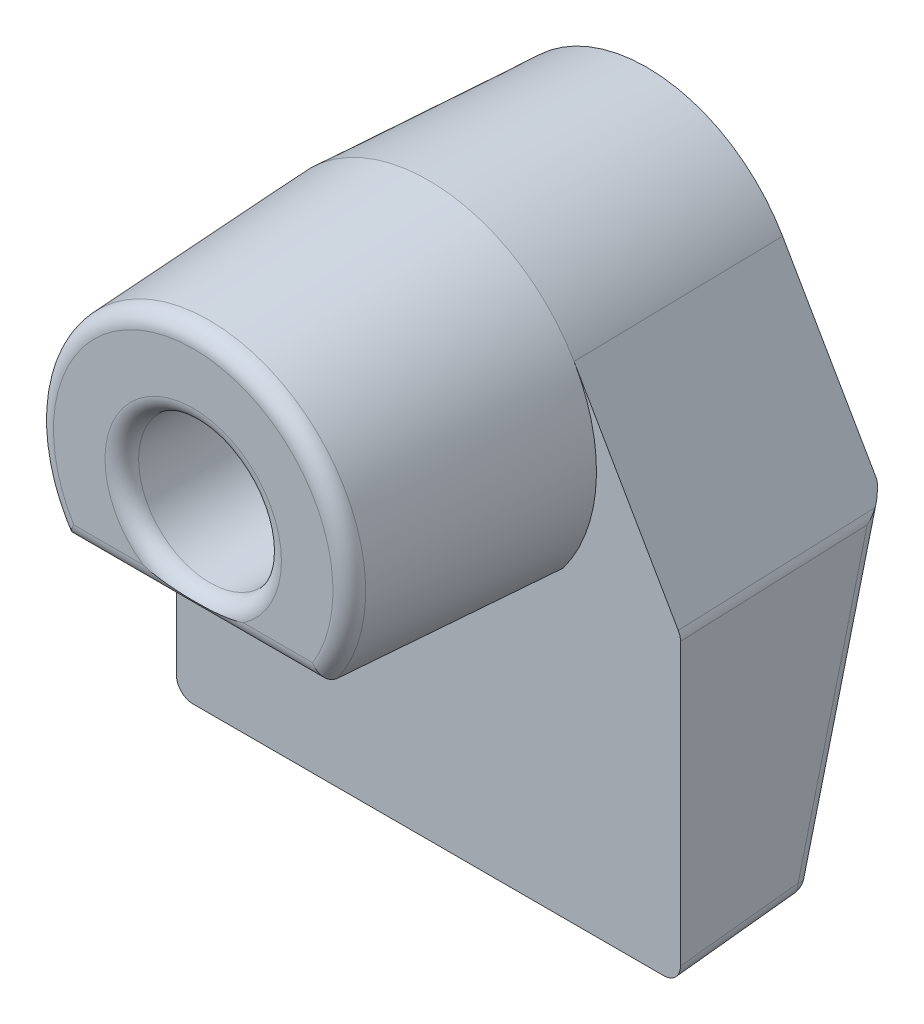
ISO-10303-21;
HEADER;
FILE_DESCRIPTION(('STEP AP214'),'2;1');
FILE_NAME('part.step','',(''),(''),'','','');
FILE_SCHEMA(('AUTOMOTIVE_DESIGN { 1 0 10303 214 1 1 1 1 }'));
ENDSEC;
DATA;
#1=APPLICATION_CONTEXT('core data for automotive mechanical design processes');
#2=APPLICATION_PROTOCOL_DEFINITION('international standard','automotive_design',2000,#1);
#3=PRODUCT_CONTEXT('',#1,'mechanical');
#4=PRODUCT('Part','Part','',(#3));
#5=PRODUCT_RELATED_PRODUCT_CATEGORY('part','',(#4));
#6=PRODUCT_DEFINITION_FORMATION('','',#4);
#7=PRODUCT_DEFINITION_CONTEXT('part definition',#1,'design');
#8=PRODUCT_DEFINITION('design','',#6,#7);
#9=PRODUCT_DEFINITION_SHAPE('','',#8);
#10=(LENGTH_UNIT() NAMED_UNIT(*) SI_UNIT(.MILLI.,.METRE.));
#11=(NAMED_UNIT(*) PLANE_ANGLE_UNIT() SI_UNIT($,.RADIAN.));
#12=(NAMED_UNIT(*) SI_UNIT($,.STERADIAN.) SOLID_ANGLE_UNIT());
#13=UNCERTAINTY_MEASURE_WITH_UNIT(LENGTH_MEASURE(1.E-05),#10,'distance_accuracy_value','');
#14=(GEOMETRIC_REPRESENTATION_CONTEXT(3) GLOBAL_UNCERTAINTY_ASSIGNED_CONTEXT((#13)) GLOBAL_UNIT_ASSIGNED_CONTEXT((#10,
#11,#12)) REPRESENTATION_CONTEXT('',''));
#15=CARTESIAN_POINT('',(0.,0.,0.));
#16=DIRECTION('',(0.,0.,1.));
#17=DIRECTION('',(1.,0.,0.));
#18=AXIS2_PLACEMENT_3D('',#15,#16,#17);
#19=CARTESIAN_POINT('',(0.,0.,0.));
#20=DIRECTION('',(0.,0.,-1.));
#21=DIRECTION('',(1.,0.,0.));
#22=AXIS2_PLACEMENT_3D('',#19,#20,#21);
#23=CONICAL_SURFACE('',#22,10.,0.05235987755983);
#24=CARTESIAN_POINT('',(-7.62432480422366,-5.26629109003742,14.));
#25=CARTESIAN_POINT('',(-7.68844151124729,-5.38857379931,11.6667069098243));
#26=CARTESIAN_POINT('',(-7.75180613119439,-5.51085756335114,9.33339369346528));
#27=CARTESIAN_POINT('',(-7.87703119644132,-5.75542720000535,4.6667270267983));
#28=CARTESIAN_POINT('',(-7.93889164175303,-5.8777130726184,2.33337357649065));
#29=CARTESIAN_POINT('',(-8.00000000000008,-6.,0.));
#30=B_SPLINE_CURVE_WITH_KNOTS('',3,(#24,#25,#26,#27,#28,#29),.UNSPECIFIED.,.F.,.F.,(4,2,4),(0.,
7.01212311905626,14.0242461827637),.UNSPECIFIED.);
#31=CARTESIAN_POINT('',(-7.65033649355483,-5.31595605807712,13.0523359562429));
#32=VERTEX_POINT('',#31);
#33=CARTESIAN_POINT('',(-8.,-6.,0.));
#34=VERTEX_POINT('',#33);
#35=EDGE_CURVE('E159',#32,#34,#30,.T.);
#36=ORIENTED_EDGE('',*,*,#35,.F.);
#37=CARTESIAN_POINT('',(0.,0.,13.0523359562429));
#38=DIRECTION('',(0.,0.,-1.));
#39=DIRECTION('',(-1.,0.,0.));
#40=AXIS2_PLACEMENT_3D('',#37,#38,#39);
#41=CIRCLE('',#40,9.31595605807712);
#42=CARTESIAN_POINT('',(7.65033649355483,-5.31595605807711,13.0523359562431));
#43=VERTEX_POINT('',#42);
#44=EDGE_CURVE('E241',#32,#43,#41,.T.);
#45=ORIENTED_EDGE('',*,*,#44,.T.);
#46=CARTESIAN_POINT('',(8.,-6.,0.));
#47=CARTESIAN_POINT('',(7.93889164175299,-5.8777130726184,2.33337357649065));
#48=CARTESIAN_POINT('',(7.87703119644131,-5.75542720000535,4.66672702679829));
#49=CARTESIAN_POINT('',(7.7518061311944,-5.51085756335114,9.33339369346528));
#50=CARTESIAN_POINT('',(7.6884415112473,-5.38857379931,11.6667069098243));
#51=CARTESIAN_POINT('',(7.62432480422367,-5.26629109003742,14.));
#52=B_SPLINE_CURVE_WITH_KNOTS('',3,(#46,#47,#48,#49,#50,#51),.UNSPECIFIED.,.F.,.F.,(4,2,4),(0.,
7.0121230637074,14.0242461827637),.UNSPECIFIED.);
#53=CARTESIAN_POINT('',(8.,-6.,0.));
#54=VERTEX_POINT('',#53);
#55=EDGE_CURVE('E170',#54,#43,#52,.T.);
#56=ORIENTED_EDGE('',*,*,#55,.F.);
#57=CARTESIAN_POINT('',(0.,0.,0.));
#58=DIRECTION('',(0.,0.,-1.));
#59=DIRECTION('',(-1.,0.,0.));
#60=AXIS2_PLACEMENT_3D('',#57,#58,#59);
#61=CIRCLE('',#60,10.);
#62=CARTESIAN_POINT('',(8.66404081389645,4.99343536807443,0.));
#63=VERTEX_POINT('',#62);
#64=EDGE_CURVE('E181',#54,#63,#61,.F.);
#65=ORIENTED_EDGE('',*,*,#64,.T.);
#66=CARTESIAN_POINT('',(0.,0.,0.));
#67=DIRECTION('',(0.,0.,-1.));
#68=DIRECTION('',(-1.,0.,0.));
#69=AXIS2_PLACEMENT_3D('',#66,#67,#68);
#70=CIRCLE('',#69,10.);
#71=CARTESIAN_POINT('',(-8.66404081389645,4.99343536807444,0.));
#72=VERTEX_POINT('',#71);
#73=EDGE_CURVE('E185',#72,#63,#70,.T.);
#74=ORIENTED_EDGE('',*,*,#73,.F.);
#75=CARTESIAN_POINT('',(0.,0.,0.));
#76=DIRECTION('',(0.,0.,1.));
#77=DIRECTION('',(1.,0.,0.));
#78=AXIS2_PLACEMENT_3D('',#75,#76,#77);
#79=CIRCLE('',#78,10.);
#80=EDGE_CURVE('E178',#72,#34,#79,.T.);
#81=ORIENTED_EDGE('',*,*,#80,.T.);
#82=EDGE_LOOP('',(#36,#45,#56,#65,#74,#81));
#83=FACE_BOUND('',#82,.T.);
#84=ADVANCED_FACE('F32',(#83),#23,.T.);
#85=CARTESIAN_POINT('',(0.,0.,0.));
#86=DIRECTION('',(0.,0.,1.));
#87=DIRECTION('',(-1.,0.,0.));
#88=AXIS2_PLACEMENT_3D('',#85,#86,#87);
#89=CONICAL_SURFACE('',#88,10.,0.05235987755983);
#90=DIRECTION('',(-0.0453440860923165,0.0261336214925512,0.998629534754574));
#91=VECTOR('',#90,1.);
#92=CARTESIAN_POINT('',(-8.66404081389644,4.99343536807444,0.));
#93=LINE('',#92,#91);
#94=CARTESIAN_POINT('',(-8.07375873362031,4.65323205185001,-13.));
#95=VERTEX_POINT('',#94);
#96=EDGE_CURVE('E192',#95,#72,#93,.T.);
#97=ORIENTED_EDGE('',*,*,#96,.T.);
#98=ORIENTED_EDGE('',*,*,#73,.T.);
#99=DIRECTION('',(0.0453440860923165,0.0261336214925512,0.998629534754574));
#100=VECTOR('',#99,1.);
#101=CARTESIAN_POINT('',(8.66404081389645,4.99343536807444,0.));
#102=LINE('',#101,#100);
#103=CARTESIAN_POINT('',(8.07375873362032,4.65323205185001,-13.));
#104=VERTEX_POINT('',#103);
#105=EDGE_CURVE('E206',#104,#63,#102,.T.);
#106=ORIENTED_EDGE('',*,*,#105,.F.);
#107=CARTESIAN_POINT('',(0.,0.,-13.));
#108=DIRECTION('',(0.,0.,-1.));
#109=DIRECTION('',(-1.,0.,0.));
#110=AXIS2_PLACEMENT_3D('',#107,#108,#109);
#111=CIRCLE('',#110,9.31869886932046);
#112=EDGE_CURVE('E204',#95,#104,#111,.T.);
#113=ORIENTED_EDGE('',*,*,#112,.F.);
#114=EDGE_LOOP('',(#97,#98,#106,#113));
#115=FACE_BOUND('',#114,.T.);
#116=ADVANCED_FACE('F319',(#115),#89,.T.);
#117=CARTESIAN_POINT('',(0.,0.,14.));
#118=DIRECTION('',(0.,0.,1.));
#119=DIRECTION('',(1.,0.,0.));
#120=AXIS2_PLACEMENT_3D('',#117,#118,#119);
#121=PLANE('',#120);
#122=DIRECTION('',(-1.,0.,0.));
#123=VECTOR('',#122,1.);
#124=CARTESIAN_POINT('',(0.,-4.31732652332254,14.));
#125=LINE('',#124,#123);
#126=CARTESIAN_POINT('',(2.98717118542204,-4.31732652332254,14.));
#127=VERTEX_POINT('',#126);
#128=CARTESIAN_POINT('',(7.10905142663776,-4.31732652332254,14.));
#129=VERTEX_POINT('',#128);
#130=EDGE_CURVE('E234',#127,#129,#125,.F.);
#131=ORIENTED_EDGE('',*,*,#130,.T.);
#132=CARTESIAN_POINT('',(0.,0.,14.));
#133=DIRECTION('',(0.,0.,1.));
#134=DIRECTION('',(1.,0.,0.));
#135=AXIS2_PLACEMENT_3D('',#132,#133,#134);
#136=CIRCLE('',#135,8.31732652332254);
#137=CARTESIAN_POINT('',(-7.10905142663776,-4.31732652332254,14.));
#138=VERTEX_POINT('',#137);
#139=EDGE_CURVE('E239',#129,#138,#136,.T.);
#140=ORIENTED_EDGE('',*,*,#139,.T.);
#141=DIRECTION('',(-1.,0.,0.));
#142=VECTOR('',#141,1.);
#143=CARTESIAN_POINT('',(0.,-4.31732652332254,14.));
#144=LINE('',#143,#142);
#145=CARTESIAN_POINT('',(-2.98717118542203,-4.31732652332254,14.));
#146=VERTEX_POINT('',#145);
#147=EDGE_CURVE('E236',#138,#146,#144,.F.);
#148=ORIENTED_EDGE('',*,*,#147,.T.);
#149=CARTESIAN_POINT('',(0.,0.,14.));
#150=DIRECTION('',(0.,0.,1.));
#151=DIRECTION('',(1.,0.,0.));
#152=AXIS2_PLACEMENT_3D('',#149,#150,#151);
#153=CIRCLE('',#152,5.25);
#154=CARTESIAN_POINT('',(5.25,0.,14.));
#155=VERTEX_POINT('',#154);
#156=EDGE_CURVE('E230',#146,#155,#153,.F.);
#157=ORIENTED_EDGE('',*,*,#156,.T.);
#158=CARTESIAN_POINT('',(0.,0.,14.));
#159=DIRECTION('',(0.,0.,1.));
#160=DIRECTION('',(1.,0.,0.));
#161=AXIS2_PLACEMENT_3D('',#158,#159,#160);
#162=CIRCLE('',#161,5.25);
#163=EDGE_CURVE('E232',#155,#127,#162,.F.);
#164=ORIENTED_EDGE('',*,*,#163,.T.);
#165=EDGE_LOOP('',(#131,#140,#148,#157,#164));
#166=FACE_BOUND('',#165,.T.);
#167=ADVANCED_FACE('F311',(#166),#121,.T.);
#168=CARTESIAN_POINT('',(0.,0.,0.));
#169=DIRECTION('',(0.,0.,1.));
#170=DIRECTION('',(-1.,0.,0.));
#171=AXIS2_PLACEMENT_3D('',#168,#169,#170);
#172=CONICAL_SURFACE('',#171,10.,0.05235987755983);
#173=CARTESIAN_POINT('',(0.,0.,-13.));
#174=DIRECTION('',(0.,0.,-1.));
#175=DIRECTION('',(-1.,0.,0.));
#176=AXIS2_PLACEMENT_3D('',#173,#174,#175);
#177=CIRCLE('',#176,9.31869886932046);
#178=CARTESIAN_POINT('',(7.63709772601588,-5.33974596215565,-13.));
#179=VERTEX_POINT('',#178);
#180=CARTESIAN_POINT('',(-7.63709772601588,-5.33974596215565,-13.));
#181=VERTEX_POINT('',#180);
#182=EDGE_CURVE('E182',#179,#181,#177,.T.);
#183=ORIENTED_EDGE('',*,*,#182,.F.);
#184=CARTESIAN_POINT('',(0.,-0.129831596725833,-14.3959923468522));
#185=DIRECTION('',(0.,-0.258819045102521,-0.965925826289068));
#186=DIRECTION('',(0.,-0.965925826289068,0.258819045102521));
#187=AXIS2_PLACEMENT_3D('',#184,#185,#186);
#188=ELLIPSE('',#187,9.57168527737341,9.24462637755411);
#189=EDGE_CURVE('E187',#179,#181,#188,.T.);
#190=ORIENTED_EDGE('',*,*,#189,.T.);
#191=EDGE_LOOP('',(#183,#190));
#192=FACE_BOUND('',#191,.T.);
#193=ADVANCED_FACE('F308',(#192),#172,.T.);
#194=CARTESIAN_POINT('',(0.,0.,14.));
#195=DIRECTION('',(0.,0.,-1.));
#196=DIRECTION('',(-1.,0.,0.));
#197=AXIS2_PLACEMENT_3D('',#194,#195,#196);
#198=CYLINDRICAL_SURFACE('',#197,4.25);
#199=CARTESIAN_POINT('',(0.,0.,13.));
#200=DIRECTION('',(0.,0.,1.));
#201=DIRECTION('',(1.,0.,0.));
#202=AXIS2_PLACEMENT_3D('',#199,#200,#201);
#203=CIRCLE('',#202,4.25);
#204=CARTESIAN_POINT('',(4.25,0.,13.));
#205=VERTEX_POINT('',#204);
#206=EDGE_CURVE('E243',#205,#205,#203,.T.);
#207=ORIENTED_EDGE('',*,*,#206,.T.);
#208=EDGE_LOOP('',(#207));
#209=FACE_BOUND('',#208,.T.);
#210=CARTESIAN_POINT('',(0.,0.,-13.));
#211=DIRECTION('',(0.,0.,-1.));
#212=DIRECTION('',(-1.,0.,0.));
#213=AXIS2_PLACEMENT_3D('',#210,#211,#212);
#214=CIRCLE('',#213,4.25);
#215=CARTESIAN_POINT('',(-4.25,0.,-13.));
#216=VERTEX_POINT('',#215);
#217=EDGE_CURVE('E226',#216,#216,#214,.T.);
#218=ORIENTED_EDGE('',*,*,#217,.T.);
#219=EDGE_LOOP('',(#218));
#220=FACE_BOUND('',#219,.T.);
#221=ADVANCED_FACE('F310',(#209,#220),#198,.F.);
#222=CARTESIAN_POINT('',(-15.,-24.,-8.));
#223=DIRECTION('',(0.,-0.258819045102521,-0.965925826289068));
#224=DIRECTION('',(0.,0.965925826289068,-0.258819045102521));
#225=AXIS2_PLACEMENT_3D('',#222,#223,#224);
#226=PLANE('',#225);
#227=DIRECTION('',(1.,0.,0.));
#228=VECTOR('',#227,1.);
#229=CARTESIAN_POINT('',(-14.5747663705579,-22.8729801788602,-8.30198405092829));
#230=LINE('',#229,#228);
#231=CARTESIAN_POINT('',(13.6141611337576,-22.8729801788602,-8.30198405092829));
#232=VERTEX_POINT('',#231);
#233=CARTESIAN_POINT('',(-13.6141611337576,-22.8729801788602,-8.30198405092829));
#234=VERTEX_POINT('',#233);
#235=EDGE_CURVE('E248',#232,#234,#230,.F.);
#236=ORIENTED_EDGE('',*,*,#235,.T.);
#237=DIRECTION('',(-0.0135628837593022,-0.965836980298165,0.258795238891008));
#238=VECTOR('',#237,1.);
#239=CARTESIAN_POINT('',(-13.3799105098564,-6.19157825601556,-12.7717522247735));
#240=LINE('',#239,#238);
#241=CARTESIAN_POINT('',(-13.3679485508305,-5.33974596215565,-13.));
#242=VERTEX_POINT('',#241);
#243=EDGE_CURVE('E250',#234,#242,#240,.F.);
#244=ORIENTED_EDGE('',*,*,#243,.T.);
#245=DIRECTION('',(1.,0.,0.));
#246=VECTOR('',#245,1.);
#247=CARTESIAN_POINT('',(-15.,-5.33974596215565,-13.));
#248=LINE('',#247,#246);
#249=EDGE_CURVE('E196',#181,#242,#248,.F.);
#250=ORIENTED_EDGE('',*,*,#249,.F.);
#251=ORIENTED_EDGE('',*,*,#189,.F.);
#252=DIRECTION('',(-1.,0.,0.));
#253=VECTOR('',#252,1.);
#254=CARTESIAN_POINT('',(0.,-5.33974596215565,-13.));
#255=LINE('',#254,#253);
#256=CARTESIAN_POINT('',(13.3679485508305,-5.33974596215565,-13.));
#257=VERTEX_POINT('',#256);
#258=EDGE_CURVE('E190',#179,#257,#255,.F.);
#259=ORIENTED_EDGE('',*,*,#258,.T.);
#260=DIRECTION('',(-0.0135628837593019,0.965836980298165,-0.258795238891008));
#261=VECTOR('',#260,1.);
#262=CARTESIAN_POINT('',(13.6241909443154,-23.5872207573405,-8.11060386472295));
#263=LINE('',#262,#261);
#264=EDGE_CURVE('E246',#257,#232,#263,.F.);
#265=ORIENTED_EDGE('',*,*,#264,.T.);
#266=EDGE_LOOP('',(#236,#244,#250,#251,#259,#265));
#267=FACE_BOUND('',#266,.T.);
#268=ADVANCED_FACE('F302',(#267),#226,.T.);
#269=CARTESIAN_POINT('',(0.,0.,0.));
#270=DIRECTION('',(0.,0.,-1.));
#271=DIRECTION('',(-1.,0.,0.));
#272=AXIS2_PLACEMENT_3D('',#269,#270,#271);
#273=PLANE('',#272);
#274=DIRECTION('',(0.,-1.,0.));
#275=VECTOR('',#274,1.);
#276=CARTESIAN_POINT('',(-15.,0.,0.));
#277=LINE('',#276,#275);
#278=CARTESIAN_POINT('',(-15.,-23.0013704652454,0.));
#279=VERTEX_POINT('',#278);
#280=CARTESIAN_POINT('',(-15.,-6.26717644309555,0.));
#281=VERTEX_POINT('',#280);
#282=EDGE_CURVE('E169',#279,#281,#277,.F.);
#283=ORIENTED_EDGE('',*,*,#282,.F.);
#284=CARTESIAN_POINT('',(-13.9986276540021,-22.9986276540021,0.));
#285=DIRECTION('',(0.,0.,-1.));
#286=DIRECTION('',(-0.707106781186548,-0.707106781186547,0.));
#287=AXIS2_PLACEMENT_3D('',#284,#285,#286);
#288=ELLIPSE('',#287,1.00274281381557,1.);
#289=CARTESIAN_POINT('',(-14.0013704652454,-24.,0.));
#290=VERTEX_POINT('',#289);
#291=EDGE_CURVE('E273',#279,#290,#288,.F.);
#292=ORIENTED_EDGE('',*,*,#291,.T.);
#293=DIRECTION('',(1.,0.,0.));
#294=VECTOR('',#293,1.);
#295=CARTESIAN_POINT('',(0.,-24.,0.));
#296=LINE('',#295,#294);
#297=CARTESIAN_POINT('',(14.0013704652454,-24.,0.));
#298=VERTEX_POINT('',#297);
#299=EDGE_CURVE('E209',#298,#290,#296,.F.);
#300=ORIENTED_EDGE('',*,*,#299,.F.);
#301=CARTESIAN_POINT('',(13.9986276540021,-22.9986276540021,0.));
#302=DIRECTION('',(0.,0.,-1.));
#303=DIRECTION('',(0.707106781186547,-0.707106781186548,0.));
#304=AXIS2_PLACEMENT_3D('',#301,#302,#303);
#305=ELLIPSE('',#304,1.00274281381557,1.);
#306=CARTESIAN_POINT('',(15.,-23.0013704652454,0.));
#307=VERTEX_POINT('',#306);
#308=EDGE_CURVE('E267',#298,#307,#305,.F.);
#309=ORIENTED_EDGE('',*,*,#308,.T.);
#310=DIRECTION('',(0.,1.,0.));
#311=VECTOR('',#310,1.);
#312=CARTESIAN_POINT('',(15.,0.,0.));
#313=LINE('',#312,#311);
#314=CARTESIAN_POINT('',(15.,-6.26717644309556,0.));
#315=VERTEX_POINT('',#314);
#316=EDGE_CURVE('E213',#315,#307,#313,.F.);
#317=ORIENTED_EDGE('',*,*,#316,.F.);
#318=CARTESIAN_POINT('',(13.9986276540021,-6.26791026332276,0.));
#319=DIRECTION('',(0.,0.,-1.));
#320=DIRECTION('',(0.966023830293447,0.25845301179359,0.));
#321=AXIS2_PLACEMENT_3D('',#318,#319,#320);
#322=ELLIPSE('',#321,1.00147050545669,1.);
#323=CARTESIAN_POINT('',(14.866587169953,-5.76851723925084,0.));
#324=VERTEX_POINT('',#323);
#325=EDGE_CURVE('E269',#315,#324,#322,.F.);
#326=ORIENTED_EDGE('',*,*,#325,.T.);
#327=DIRECTION('',(-0.499343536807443,0.866404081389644,0.));
#328=VECTOR('',#327,1.);
#329=CARTESIAN_POINT('',(8.66404081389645,4.99343536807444,0.));
#330=LINE('',#329,#328);
#331=EDGE_CURVE('E211',#63,#324,#330,.F.);
#332=ORIENTED_EDGE('',*,*,#331,.F.);
#333=ORIENTED_EDGE('',*,*,#64,.F.);
#334=DIRECTION('',(-1.,0.,0.));
#335=VECTOR('',#334,1.);
#336=CARTESIAN_POINT('',(15.,-6.,0.));
#337=LINE('',#336,#335);
#338=EDGE_CURVE('E163',#54,#34,#337,.T.);
#339=ORIENTED_EDGE('',*,*,#338,.T.);
#340=ORIENTED_EDGE('',*,*,#80,.F.);
#341=DIRECTION('',(-0.499343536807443,-0.866404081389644,0.));
#342=VECTOR('',#341,1.);
#343=CARTESIAN_POINT('',(-8.66404081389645,4.99343536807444,0.));
#344=LINE('',#343,#342);
#345=CARTESIAN_POINT('',(-14.866587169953,-5.76851723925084,0.));
#346=VERTEX_POINT('',#345);
#347=EDGE_CURVE('E214',#346,#72,#344,.F.);
#348=ORIENTED_EDGE('',*,*,#347,.F.);
#349=CARTESIAN_POINT('',(-13.9986276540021,-6.26791026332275,0.));
#350=DIRECTION('',(0.,0.,-1.));
#351=DIRECTION('',(-0.966023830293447,0.25845301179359,0.));
#352=AXIS2_PLACEMENT_3D('',#349,#350,#351);
#353=ELLIPSE('',#352,1.00147050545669,1.);
#354=EDGE_CURVE('E271',#346,#281,#353,.F.);
#355=ORIENTED_EDGE('',*,*,#354,.T.);
#356=EDGE_LOOP('',(#283,#292,#300,#309,#317,#326,#332,#333,#339,#340,#348,#355));
#357=FACE_BOUND('',#356,.T.);
#358=ADVANCED_FACE('F176',(#357),#273,.F.);
#359=CARTESIAN_POINT('',(-15.,0.,0.));
#360=DIRECTION('',(-0.998629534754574,0.,-0.0523359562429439));
#361=DIRECTION('',(-0.052335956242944,0.,0.998629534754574));
#362=AXIS2_PLACEMENT_3D('',#359,#360,#361);
#363=PLANE('',#362);
#364=DIRECTION('',(0.0135628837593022,0.965836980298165,-0.258795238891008));
#365=VECTOR('',#364,1.);
#366=CARTESIAN_POINT('',(-14.62282047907,-23.328401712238,-7.19701399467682));
#367=LINE('',#366,#365);
#368=CARTESIAN_POINT('',(-14.3855446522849,-6.43156973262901,-11.7245064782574));
#369=VERTEX_POINT('',#368);
#370=CARTESIAN_POINT('',(-14.6127906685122,-22.6141611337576,-7.38839418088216));
#371=VERTEX_POINT('',#370);
#372=EDGE_CURVE('E263',#369,#371,#367,.F.);
#373=ORIENTED_EDGE('',*,*,#372,.T.);
#374=DIRECTION('',(0.0522644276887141,0.052264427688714,-0.997264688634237));
#375=VECTOR('',#374,1.);
#376=CARTESIAN_POINT('',(-14.9371701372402,-22.9385406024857,-1.19886519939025));
#377=LINE('',#376,#375);
#378=EDGE_CURVE('E265',#371,#279,#377,.F.);
#379=ORIENTED_EDGE('',*,*,#378,.T.);
#380=ORIENTED_EDGE('',*,*,#282,.T.);
#381=DIRECTION('',(0.0523308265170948,-0.014000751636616,-0.998531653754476));
#382=VECTOR('',#381,1.);
#383=CARTESIAN_POINT('',(-15.0045917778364,-6.26594794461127,0.0876163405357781));
#384=LINE('',#383,#382);
#385=EDGE_CURVE('E261',#281,#369,#384,.T.);
#386=ORIENTED_EDGE('',*,*,#385,.T.);
#387=EDGE_LOOP('',(#373,#379,#380,#386));
#388=FACE_BOUND('',#387,.T.);
#389=ADVANCED_FACE('F398',(#388),#363,.T.);
#390=CARTESIAN_POINT('',(-8.66404081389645,4.99343536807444,0.));
#391=DIRECTION('',(-0.865216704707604,0.498659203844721,-0.0523359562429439));
#392=DIRECTION('',(-0.499343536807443,-0.866404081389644,0.));
#393=AXIS2_PLACEMENT_3D('',#390,#391,#392);
#394=PLANE('',#393);
#395=DIRECTION('',(0.499343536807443,0.866404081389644,0.));
#396=VECTOR('',#395,1.);
#397=CARTESIAN_POINT('',(-8.07375873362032,4.65323205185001,-13.));
#398=LINE('',#397,#396);
#399=CARTESIAN_POINT('',(-13.7024806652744,-5.11308571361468,-13.));
#400=VERTEX_POINT('',#399);
#401=EDGE_CURVE('E199',#95,#400,#398,.F.);
#402=ORIENTED_EDGE('',*,*,#401,.T.);
#403=CARTESIAN_POINT('',(-13.3588597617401,-4.43369814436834,-12.20749860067));
#404=DIRECTION('',(-0.865216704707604,0.498659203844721,-0.0523359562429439));
#405=DIRECTION('',(0.493313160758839,0.827946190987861,-0.266734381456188));
#406=AXIS2_PLACEMENT_3D('',#403,#404,#405);
#407=ELLIPSE('',#406,2.06853913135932,1.);
#408=CARTESIAN_POINT('',(-14.2185971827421,-5.94188249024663,-12.3643855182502));
#409=VERTEX_POINT('',#408);
#410=EDGE_CURVE('E259',#400,#409,#407,.T.);
#411=ORIENTED_EDGE('',*,*,#410,.T.);
#412=DIRECTION('',(0.0523308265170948,-0.014000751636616,-0.998531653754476));
#413=VECTOR('',#412,1.);
#414=CARTESIAN_POINT('',(-14.8574863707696,-5.77095209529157,-0.173653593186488));
#415=LINE('',#414,#413);
#416=EDGE_CURVE('E257',#409,#346,#415,.F.);
#417=ORIENTED_EDGE('',*,*,#416,.T.);
#418=ORIENTED_EDGE('',*,*,#347,.T.);
#419=ORIENTED_EDGE('',*,*,#96,.F.);
#420=EDGE_LOOP('',(#402,#411,#417,#418,#419));
#421=FACE_BOUND('',#420,.T.);
#422=ADVANCED_FACE('F34',(#421),#394,.T.);
#423=CARTESIAN_POINT('',(8.66404081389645,4.99343536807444,0.));
#424=DIRECTION('',(0.865216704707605,0.498659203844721,-0.0523359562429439));
#425=DIRECTION('',(-0.499343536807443,0.866404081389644,0.));
#426=AXIS2_PLACEMENT_3D('',#423,#424,#425);
#427=PLANE('',#426);
#428=ORIENTED_EDGE('',*,*,#331,.T.);
#429=DIRECTION('',(-0.0523308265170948,-0.014000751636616,-0.998531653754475));
#430=VECTOR('',#429,1.);
#431=CARTESIAN_POINT('',(14.8574863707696,-5.77095209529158,-0.173653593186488));
#432=LINE('',#431,#430);
#433=CARTESIAN_POINT('',(14.2185971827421,-5.94188249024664,-12.3643855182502));
#434=VERTEX_POINT('',#433);
#435=EDGE_CURVE('E11',#324,#434,#432,.T.);
#436=ORIENTED_EDGE('',*,*,#435,.T.);
#437=CARTESIAN_POINT('',(13.3588597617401,-4.43369814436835,-12.20749860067));
#438=DIRECTION('',(0.865216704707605,0.498659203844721,-0.0523359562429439));
#439=DIRECTION('',(0.493313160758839,-0.827946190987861,0.266734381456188));
#440=AXIS2_PLACEMENT_3D('',#437,#438,#439);
#441=ELLIPSE('',#440,2.06853913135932,1.);
#442=CARTESIAN_POINT('',(13.7024806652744,-5.11308571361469,-13.));
#443=VERTEX_POINT('',#442);
#444=EDGE_CURVE('E40',#434,#443,#441,.T.);
#445=ORIENTED_EDGE('',*,*,#444,.T.);
#446=DIRECTION('',(-0.499343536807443,0.866404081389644,0.));
#447=VECTOR('',#446,1.);
#448=CARTESIAN_POINT('',(8.07375873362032,4.65323205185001,-13.));
#449=LINE('',#448,#447);
#450=EDGE_CURVE('E202',#104,#443,#449,.F.);
#451=ORIENTED_EDGE('',*,*,#450,.F.);
#452=ORIENTED_EDGE('',*,*,#105,.T.);
#453=EDGE_LOOP('',(#428,#436,#445,#451,#452));
#454=FACE_BOUND('',#453,.T.);
#455=ADVANCED_FACE('F286',(#454),#427,.T.);
#456=CARTESIAN_POINT('',(15.,0.,0.));
#457=DIRECTION('',(0.998629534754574,0.,-0.0523359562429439));
#458=DIRECTION('',(-0.052335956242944,0.,-0.998629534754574));
#459=AXIS2_PLACEMENT_3D('',#456,#457,#458);
#460=PLANE('',#459);
#461=DIRECTION('',(0.0135628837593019,-0.965836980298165,0.258795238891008));
#462=VECTOR('',#461,1.);
#463=CARTESIAN_POINT('',(14.378540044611,-5.93275921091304,-11.8581623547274));
#464=LINE('',#463,#462);
#465=CARTESIAN_POINT('',(14.6127906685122,-22.6141611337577,-7.38839418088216));
#466=VERTEX_POINT('',#465);
#467=CARTESIAN_POINT('',(14.3855446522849,-6.43156973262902,-11.7245064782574));
#468=VERTEX_POINT('',#467);
#469=EDGE_CURVE('E53',#466,#468,#464,.F.);
#470=ORIENTED_EDGE('',*,*,#469,.T.);
#471=DIRECTION('',(-0.0523308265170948,-0.014000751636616,-0.998531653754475));
#472=VECTOR('',#471,1.);
#473=CARTESIAN_POINT('',(15.0045917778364,-6.26594794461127,0.0876163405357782));
#474=LINE('',#473,#472);
#475=EDGE_CURVE('E284',#468,#315,#474,.F.);
#476=ORIENTED_EDGE('',*,*,#475,.T.);
#477=ORIENTED_EDGE('',*,*,#316,.T.);
#478=DIRECTION('',(-0.052264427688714,0.0522644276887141,-0.997264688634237));
#479=VECTOR('',#478,1.);
#480=CARTESIAN_POINT('',(14.9371701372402,-22.9385406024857,-1.19886519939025));
#481=LINE('',#480,#479);
#482=EDGE_CURVE('E282',#307,#466,#481,.T.);
#483=ORIENTED_EDGE('',*,*,#482,.T.);
#484=EDGE_LOOP('',(#470,#476,#477,#483));
#485=FACE_BOUND('',#484,.T.);
#486=ADVANCED_FACE('F598',(#485),#460,.T.);
#487=CARTESIAN_POINT('',(0.,-24.,0.));
#488=DIRECTION('',(0.,-0.998629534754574,-0.0523359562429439));
#489=DIRECTION('',(0.,0.052335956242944,-0.998629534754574));
#490=AXIS2_PLACEMENT_3D('',#487,#488,#489);
#491=PLANE('',#490);
#492=ORIENTED_EDGE('',*,*,#299,.T.);
#493=DIRECTION('',(0.0522644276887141,0.052264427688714,-0.997264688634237));
#494=VECTOR('',#493,1.);
#495=CARTESIAN_POINT('',(-13.9631247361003,-23.9617542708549,-0.729771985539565));
#496=LINE('',#495,#494);
#497=CARTESIAN_POINT('',(-13.6141611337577,-23.6127906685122,-7.38839418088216));
#498=VERTEX_POINT('',#497);
#499=EDGE_CURVE('E279',#290,#498,#496,.T.);
#500=ORIENTED_EDGE('',*,*,#499,.T.);
#501=DIRECTION('',(-1.,0.,0.));
#502=VECTOR('',#501,1.);
#503=CARTESIAN_POINT('',(14.5747663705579,-23.6127906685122,-7.38839418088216));
#504=LINE('',#503,#502);
#505=CARTESIAN_POINT('',(13.6141611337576,-23.6127906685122,-7.38839418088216));
#506=VERTEX_POINT('',#505);
#507=EDGE_CURVE('E275',#498,#506,#504,.F.);
#508=ORIENTED_EDGE('',*,*,#507,.T.);
#509=DIRECTION('',(-0.0522644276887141,0.052264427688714,-0.997264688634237));
#510=VECTOR('',#509,1.);
#511=CARTESIAN_POINT('',(13.9631247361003,-23.9617542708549,-0.729771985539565));
#512=LINE('',#511,#510);
#513=EDGE_CURVE('E277',#506,#298,#512,.F.);
#514=ORIENTED_EDGE('',*,*,#513,.T.);
#515=EDGE_LOOP('',(#492,#500,#508,#514));
#516=FACE_BOUND('',#515,.T.);
#517=ADVANCED_FACE('F395',(#516),#491,.T.);
#518=CARTESIAN_POINT('',(15.,-6.,0.));
#519=DIRECTION('',(0.,-0.998629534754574,0.0523359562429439));
#520=DIRECTION('',(0.,-0.052335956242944,-0.998629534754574));
#521=AXIS2_PLACEMENT_3D('',#518,#519,#520);
#522=PLANE('',#521);
#523=ORIENTED_EDGE('',*,*,#55,.T.);
#524=DIRECTION('',(-1.,0.,0.));
#525=VECTOR('',#524,1.);
#526=CARTESIAN_POINT('',(15.,-5.31595605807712,13.0523359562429));
#527=LINE('',#526,#525);
#528=EDGE_CURVE('E166',#43,#32,#527,.T.);
#529=ORIENTED_EDGE('',*,*,#528,.T.);
#530=ORIENTED_EDGE('',*,*,#35,.T.);
#531=ORIENTED_EDGE('',*,*,#338,.F.);
#532=EDGE_LOOP('',(#523,#529,#530,#531));
#533=FACE_BOUND('',#532,.T.);
#534=ADVANCED_FACE('F162',(#533),#522,.T.);
#535=CARTESIAN_POINT('',(0.,0.,-13.));
#536=DIRECTION('',(0.,0.,-1.));
#537=DIRECTION('',(-1.,0.,0.));
#538=AXIS2_PLACEMENT_3D('',#535,#536,#537);
#539=PLANE('',#538);
#540=ORIENTED_EDGE('',*,*,#249,.T.);
#541=CARTESIAN_POINT('',(-13.3173265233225,-1.47604265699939,-13.));
#542=DIRECTION('',(0.,0.,-1.));
#543=DIRECTION('',(0.0140412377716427,0.999901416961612,0.));
#544=AXIS2_PLACEMENT_3D('',#541,#542,#543);
#545=ELLIPSE('',#544,3.86405872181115,1.);
#546=EDGE_CURVE('E255',#242,#400,#545,.T.);
#547=ORIENTED_EDGE('',*,*,#546,.T.);
#548=ORIENTED_EDGE('',*,*,#401,.F.);
#549=ORIENTED_EDGE('',*,*,#112,.T.);
#550=ORIENTED_EDGE('',*,*,#450,.T.);
#551=CARTESIAN_POINT('',(13.3173265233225,-1.47604265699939,-13.));
#552=DIRECTION('',(0.,0.,-1.));
#553=DIRECTION('',(0.0140412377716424,-0.999901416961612,0.));
#554=AXIS2_PLACEMENT_3D('',#551,#552,#553);
#555=ELLIPSE('',#554,3.86405872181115,1.);
#556=EDGE_CURVE('E253',#443,#257,#555,.T.);
#557=ORIENTED_EDGE('',*,*,#556,.T.);
#558=ORIENTED_EDGE('',*,*,#258,.F.);
#559=ORIENTED_EDGE('',*,*,#182,.T.);
#560=EDGE_LOOP('',(#540,#547,#548,#549,#550,#557,#558,#559));
#561=FACE_BOUND('',#560,.T.);
#562=ORIENTED_EDGE('',*,*,#217,.F.);
#563=EDGE_LOOP('',(#562));
#564=FACE_BOUND('',#563,.T.);
#565=ADVANCED_FACE('F291',(#561,#564),#539,.T.);
#566=CARTESIAN_POINT('',(0.,0.,13.));
#567=DIRECTION('',(0.,0.,1.));
#568=DIRECTION('',(1.,0.,0.));
#569=AXIS2_PLACEMENT_3D('',#566,#567,#568);
#570=TOROIDAL_SURFACE('',#569,5.25,1.);
#571=ORIENTED_EDGE('',*,*,#206,.F.);
#572=EDGE_LOOP('',(#571));
#573=FACE_BOUND('',#572,.T.);
#574=ORIENTED_EDGE('',*,*,#163,.F.);
#575=ORIENTED_EDGE('',*,*,#156,.F.);
#576=CARTESIAN_POINT('',(2.98717118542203,-4.31732652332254,14.));
#577=CARTESIAN_POINT('',(2.9845033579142,-4.31815949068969,13.9999999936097));
#578=CARTESIAN_POINT('',(2.98183520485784,-4.31899144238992,13.9999989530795));
#579=CARTESIAN_POINT('',(2.81900081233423,-4.36969630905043,13.9998727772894));
#580=CARTESIAN_POINT('',(2.65766639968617,-4.41590739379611,13.9960481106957));
#581=CARTESIAN_POINT('',(2.33309825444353,-4.50056510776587,13.9839967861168));
#582=CARTESIAN_POINT('',(2.16986362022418,-4.53900787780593,13.9757679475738));
#583=CARTESIAN_POINT('',(1.84164963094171,-4.60781876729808,13.9575396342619));
#584=CARTESIAN_POINT('',(1.67666889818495,-4.63817992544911,13.9475386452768));
#585=CARTESIAN_POINT('',(1.34539276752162,-4.69049955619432,13.9281818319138));
#586=CARTESIAN_POINT('',(1.17909780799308,-4.71246071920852,13.9188258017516));
#587=CARTESIAN_POINT('',(0.844259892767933,-4.74788777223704,13.9027743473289));
#588=CARTESIAN_POINT('',(0.675709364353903,-4.7612918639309,13.8960984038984));
#589=CARTESIAN_POINT('',(0.338105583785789,-4.77917708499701,13.88701615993));
#590=CARTESIAN_POINT('',(0.16905266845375,-4.78366323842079,13.8846074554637));
#591=CARTESIAN_POINT('',(-0.167942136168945,-4.78366328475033,13.884607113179));
#592=CARTESIAN_POINT('',(-0.33588402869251,-4.77923592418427,13.8869839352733));
#593=CARTESIAN_POINT('',(-0.67122269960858,-4.76158727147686,13.8959506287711));
#594=CARTESIAN_POINT('',(-0.838619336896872,-4.74836386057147,13.9025415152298));
#595=CARTESIAN_POINT('',(-1.17249461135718,-4.71327537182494,13.9184729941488));
#596=CARTESIAN_POINT('',(-1.33897241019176,-4.6914034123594,13.9278157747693));
#597=CARTESIAN_POINT('',(-1.67056783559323,-4.63924956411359,13.9471733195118));
#598=CARTESIAN_POINT('',(-1.83568540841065,-4.60896734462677,13.9571881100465));
#599=CARTESIAN_POINT('',(-2.16506471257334,-4.54011274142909,13.9755210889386));
#600=CARTESIAN_POINT('',(-2.32931909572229,-4.50150314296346,13.9838313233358));
#601=CARTESIAN_POINT('',(-2.65583068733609,-4.41643302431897,13.9960046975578));
#602=CARTESIAN_POINT('',(-2.81808965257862,-4.36998003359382,13.9998720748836));
#603=CARTESIAN_POINT('',(-2.98183520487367,-4.31899144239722,13.9999989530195));
#604=CARTESIAN_POINT('',(-2.98450335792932,-4.31815949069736,13.9999999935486));
#605=CARTESIAN_POINT('',(-2.98717118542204,-4.31732652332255,14.));
#606=B_SPLINE_CURVE_WITH_KNOTS('',3,(#576,#577,#578,#579,#580,#581,#582,#583,#584,#585,#586,
#587,#588,#589,#590,#591,#592,#593,#594,#595,#596,#597,#598,#599,#600,#601,#602,#603,#604,#605),
.UNSPECIFIED.,.F.,.F.,(4,2,2,2,2,2,2,2,2,2,2,2,2,2,4),(0.,0.0083845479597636,0.511637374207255,
1.01513959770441,1.51907413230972,2.0228471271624,2.53021834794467,3.03730365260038,
3.54105783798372,4.04493341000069,4.54921072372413,5.05350786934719,5.5601072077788,
6.06622296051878,6.07460750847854),.UNSPECIFIED.);
#607=EDGE_CURVE('E352',#127,#146,#606,.T.);
#608=ORIENTED_EDGE('',*,*,#607,.F.);
#609=EDGE_LOOP('',(#574,#575,#608));
#610=FACE_BOUND('',#609,.T.);
#611=ADVANCED_FACE('F377',(#573,#610),#570,.T.);
#612=CARTESIAN_POINT('',(0.,0.,13.));
#613=DIRECTION('',(0.,0.,1.));
#614=DIRECTION('',(1.,0.,0.));
#615=AXIS2_PLACEMENT_3D('',#612,#613,#614);
#616=TOROIDAL_SURFACE('',#615,8.31732652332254,1.);
#617=CARTESIAN_POINT('',(-7.65033649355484,-5.31595605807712,13.0523359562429));
#618=CARTESIAN_POINT('',(-7.64962398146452,-5.31459366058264,13.0783576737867));
#619=CARTESIAN_POINT('',(-7.6483789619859,-5.31221227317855,13.1042973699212));
#620=CARTESIAN_POINT('',(-7.64484242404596,-5.30545149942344,13.1558342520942));
#621=CARTESIAN_POINT('',(-7.64255125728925,-5.30107278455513,13.1814315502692));
#622=CARTESIAN_POINT('',(-7.63416180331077,-5.28504930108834,13.2572266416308));
#623=CARTESIAN_POINT('',(-7.62654037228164,-5.27050335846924,13.3066791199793));
#624=CARTESIAN_POINT('',(-7.60755894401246,-5.23435801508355,13.4020668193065));
#625=CARTESIAN_POINT('',(-7.59620221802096,-5.21276478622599,13.4480050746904));
#626=CARTESIAN_POINT('',(-7.57016291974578,-5.16339968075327,13.5354266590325));
#627=CARTESIAN_POINT('',(-7.55547793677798,-5.1356233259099,13.5769067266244));
#628=CARTESIAN_POINT('',(-7.52244510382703,-5.0733618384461,13.6565780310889));
#629=CARTESIAN_POINT('',(-7.50394988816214,-5.03860903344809,13.6944979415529));
#630=CARTESIAN_POINT('',(-7.46436732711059,-4.96454848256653,13.7639928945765));
#631=CARTESIAN_POINT('',(-7.44327900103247,-4.92523901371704,13.7955655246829));
#632=CARTESIAN_POINT('',(-7.39654537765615,-4.83853483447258,13.8552275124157));
#633=CARTESIAN_POINT('',(-7.37065433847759,-4.79072811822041,13.8825243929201));
#634=CARTESIAN_POINT('',(-7.31698311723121,-4.69219025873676,13.9286757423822));
#635=CARTESIAN_POINT('',(-7.28920231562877,-4.64145815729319,13.9475274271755));
#636=CARTESIAN_POINT('',(-7.2367186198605,-4.54618939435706,13.9745191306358));
#637=CARTESIAN_POINT('',(-7.21219154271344,-4.50188625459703,13.9838534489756));
#638=CARTESIAN_POINT('',(-7.16260590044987,-4.41278884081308,13.9964464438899));
#639=CARTESIAN_POINT('',(-7.13754831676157,-4.36799553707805,13.9997154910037));
#640=CARTESIAN_POINT('',(-7.1112875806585,-4.32130122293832,13.9999940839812));
#641=CARTESIAN_POINT('',(-7.11016957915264,-4.31931377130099,14.0000000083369));
#642=CARTESIAN_POINT('',(-7.10905142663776,-4.31732652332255,14.));
#643=B_SPLINE_CURVE_WITH_KNOTS('',3,(#617,#618,#619,#620,#621,#622,#623,#624,#625,#626,#627,
#628,#629,#630,#631,#632,#633,#634,#635,#636,#637,#638,#639,#640,#641,#642),.UNSPECIFIED.,.F.,
.F.,(4,2,2,2,2,2,2,2,2,2,2,2,4),(0.,0.0781488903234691,0.156271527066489,0.311771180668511,
0.467135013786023,0.622611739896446,0.78592872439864,0.949307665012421,1.13108243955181,
1.31291709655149,1.46705163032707,1.62092237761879,1.62776334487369),.UNSPECIFIED.);
#644=EDGE_CURVE('E353',#138,#32,#643,.F.);
#645=ORIENTED_EDGE('',*,*,#644,.F.);
#646=ORIENTED_EDGE('',*,*,#139,.F.);
#647=CARTESIAN_POINT('',(7.65033649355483,-5.31595605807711,13.0523359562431));
#648=CARTESIAN_POINT('',(7.64962398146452,-5.31459366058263,13.0783576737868));
#649=CARTESIAN_POINT('',(7.6483789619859,-5.31221227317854,13.1042973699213));
#650=CARTESIAN_POINT('',(7.64484242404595,-5.30545149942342,13.1558342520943));
#651=CARTESIAN_POINT('',(7.64255125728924,-5.30107278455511,13.1814315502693));
#652=CARTESIAN_POINT('',(7.63416180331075,-5.28504930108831,13.2572266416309));
#653=CARTESIAN_POINT('',(7.62654037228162,-5.2705033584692,13.3066791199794));
#654=CARTESIAN_POINT('',(7.60755894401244,-5.2343580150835,13.4020668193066));
#655=CARTESIAN_POINT('',(7.59620221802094,-5.21276478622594,13.4480050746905));
#656=CARTESIAN_POINT('',(7.57016291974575,-5.1633996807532,13.5354266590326));
#657=CARTESIAN_POINT('',(7.55547793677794,-5.13562332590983,13.5769067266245));
#658=CARTESIAN_POINT('',(7.52244510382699,-5.07336183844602,13.656578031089));
#659=CARTESIAN_POINT('',(7.5039498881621,-5.038609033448,13.694497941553));
#660=CARTESIAN_POINT('',(7.46436732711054,-4.96454848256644,13.7639928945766));
#661=CARTESIAN_POINT('',(7.44327900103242,-4.92523901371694,13.795565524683));
#662=CARTESIAN_POINT('',(7.3965453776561,-4.83853483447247,13.8552275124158));
#663=CARTESIAN_POINT('',(7.37065433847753,-4.79072811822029,13.8825243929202));
#664=CARTESIAN_POINT('',(7.31698311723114,-4.69219025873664,13.9286757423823));
#665=CARTESIAN_POINT('',(7.28920231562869,-4.64145815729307,13.9475274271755));
#666=CARTESIAN_POINT('',(7.23671861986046,-4.54618939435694,13.9745191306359));
#667=CARTESIAN_POINT('',(7.21219154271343,-4.50188625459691,13.9838534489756));
#668=CARTESIAN_POINT('',(7.16260590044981,-4.41278884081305,13.9964464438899));
#669=CARTESIAN_POINT('',(7.1375483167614,-4.3679955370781,13.9997154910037));
#670=CARTESIAN_POINT('',(7.11128758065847,-4.32130122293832,13.9999940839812));
#671=CARTESIAN_POINT('',(7.11016957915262,-4.31931377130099,14.0000000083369));
#672=CARTESIAN_POINT('',(7.10905142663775,-4.31732652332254,14.));
#673=B_SPLINE_CURVE_WITH_KNOTS('',3,(#647,#648,#649,#650,#651,#652,#653,#654,#655,#656,#657,
#658,#659,#660,#661,#662,#663,#664,#665,#666,#667,#668,#669,#670,#671,#672),.UNSPECIFIED.,.F.,
.F.,(4,2,2,2,2,2,2,2,2,2,2,2,4),(0.,0.0781488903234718,0.156271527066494,0.311771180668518,
0.467135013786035,0.62261173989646,0.785928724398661,0.949307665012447,1.13108243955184,
1.31291709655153,1.46705163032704,1.62092237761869,1.62776334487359),.UNSPECIFIED.);
#674=EDGE_CURVE('E347',#43,#129,#673,.T.);
#675=ORIENTED_EDGE('',*,*,#674,.F.);
#676=ORIENTED_EDGE('',*,*,#44,.F.);
#677=EDGE_LOOP('',(#645,#646,#675,#676));
#678=FACE_BOUND('',#677,.T.);
#679=ADVANCED_FACE('F349',(#678),#616,.T.);
#680=CARTESIAN_POINT('',(15.,-4.31732652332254,13.));
#681=DIRECTION('',(-1.,0.,0.));
#682=DIRECTION('',(0.,-1.,0.));
#683=AXIS2_PLACEMENT_3D('',#680,#681,#682);
#684=CYLINDRICAL_SURFACE('',#683,1.);
#685=ORIENTED_EDGE('',*,*,#607,.T.);
#686=ORIENTED_EDGE('',*,*,#147,.F.);
#687=ORIENTED_EDGE('',*,*,#644,.T.);
#688=ORIENTED_EDGE('',*,*,#528,.F.);
#689=ORIENTED_EDGE('',*,*,#674,.T.);
#690=ORIENTED_EDGE('',*,*,#130,.F.);
#691=EDGE_LOOP('',(#685,#686,#687,#688,#689,#690));
#692=FACE_BOUND('',#691,.T.);
#693=ADVANCED_FACE('F355',(#692),#684,.T.);
#694=CARTESIAN_POINT('',(14.0059622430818,-6.26594794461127,0.139952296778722));
#695=DIRECTION('',(0.0523308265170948,0.014000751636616,0.998531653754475));
#696=DIRECTION('',(0.998629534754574,0.,-0.0523359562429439));
#697=AXIS2_PLACEMENT_3D('',#694,#695,#696);
#698=CYLINDRICAL_SURFACE('',#697,1.);
#699=ORIENTED_EDGE('',*,*,#325,.F.);
#700=ORIENTED_EDGE('',*,*,#475,.F.);
#701=CARTESIAN_POINT('',(13.3869151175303,-6.43156973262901,-11.6721705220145));
#702=DIRECTION('',(-0.0315615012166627,-0.797699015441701,-0.602229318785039));
#703=DIRECTION('',(0.0417483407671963,-0.603055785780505,0.796605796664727));
#704=AXIS2_PLACEMENT_3D('',#701,#702,#703);
#705=ELLIPSE('',#704,1.6282267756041,1.);
#706=EDGE_CURVE('E357',#434,#468,#705,.T.);
#707=ORIENTED_EDGE('',*,*,#706,.F.);
#708=ORIENTED_EDGE('',*,*,#435,.F.);
#709=EDGE_LOOP('',(#699,#700,#707,#708));
#710=FACE_BOUND('',#709,.T.);
#711=ADVANCED_FACE('F376',(#710),#698,.T.);
#712=CARTESIAN_POINT('',(13.9631247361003,-22.9631247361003,-0.677436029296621));
#713=DIRECTION('',(0.052264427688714,-0.052264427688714,0.997264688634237));
#714=DIRECTION('',(0.,-0.998629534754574,-0.052335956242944));
#715=AXIS2_PLACEMENT_3D('',#712,#713,#714);
#716=CYLINDRICAL_SURFACE('',#715,1.);
#717=ORIENTED_EDGE('',*,*,#308,.F.);
#718=ORIENTED_EDGE('',*,*,#513,.F.);
#719=CARTESIAN_POINT('',(13.6141611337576,-22.6141611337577,-7.33605822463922));
#720=DIRECTION('',(-0.052264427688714,0.0522644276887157,-0.997264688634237));
#721=DIRECTION('',(0.,0.998629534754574,0.0523359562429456));
#722=AXIS2_PLACEMENT_3D('',#719,#720,#721);
#723=CIRCLE('',#722,1.);
#724=EDGE_CURVE('E359',#466,#506,#723,.T.);
#725=ORIENTED_EDGE('',*,*,#724,.F.);
#726=ORIENTED_EDGE('',*,*,#482,.F.);
#727=EDGE_LOOP('',(#717,#718,#725,#726));
#728=FACE_BOUND('',#727,.T.);
#729=ADVANCED_FACE('F477',(#728),#716,.T.);
#730=CARTESIAN_POINT('',(13.6247209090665,-23.3661414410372,-7.13456570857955));
#731=DIRECTION('',(0.0135628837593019,-0.965836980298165,0.258795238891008));
#732=DIRECTION('',(0.,-0.258819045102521,-0.965925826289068));
#733=AXIS2_PLACEMENT_3D('',#730,#731,#732);
#734=CYLINDRICAL_SURFACE('',#733,1.);
#735=ORIENTED_EDGE('',*,*,#706,.T.);
#736=ORIENTED_EDGE('',*,*,#469,.F.);
#737=CARTESIAN_POINT('',(13.6141611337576,-22.6141611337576,-7.33605822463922));
#738=DIRECTION('',(0.0135628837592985,-0.965836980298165,0.25879523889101));
#739=DIRECTION('',(0.,-0.258819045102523,-0.965925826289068));
#740=AXIS2_PLACEMENT_3D('',#737,#738,#739);
#741=CIRCLE('',#740,1.);
#742=EDGE_CURVE('E299',#232,#466,#741,.T.);
#743=ORIENTED_EDGE('',*,*,#742,.F.);
#744=ORIENTED_EDGE('',*,*,#264,.F.);
#745=ORIENTED_EDGE('',*,*,#556,.F.);
#746=ORIENTED_EDGE('',*,*,#444,.F.);
#747=EDGE_LOOP('',(#735,#736,#743,#744,#745,#746));
#748=FACE_BOUND('',#747,.T.);
#749=ADVANCED_FACE('F296',(#748),#734,.T.);
#750=CARTESIAN_POINT('',(13.6141611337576,-22.6141611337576,-7.33605822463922));
#751=DIRECTION('',(0.,0.,1.));
#752=DIRECTION('',(1.,0.,0.));
#753=AXIS2_PLACEMENT_3D('',#750,#751,#752);
#754=SPHERICAL_SURFACE('',#753,1.);
#755=ORIENTED_EDGE('',*,*,#742,.T.);
#756=ORIENTED_EDGE('',*,*,#724,.T.);
#757=CARTESIAN_POINT('',(13.6141611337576,-22.6141611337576,-7.33605822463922));
#758=DIRECTION('',(1.,0.,0.));
#759=DIRECTION('',(0.,0.,-1.));
#760=AXIS2_PLACEMENT_3D('',#757,#758,#759);
#761=CIRCLE('',#760,1.);
#762=EDGE_CURVE('E577',#232,#506,#761,.F.);
#763=ORIENTED_EDGE('',*,*,#762,.F.);
#764=EDGE_LOOP('',(#755,#756,#763));
#765=FACE_BOUND('',#764,.T.);
#766=ADVANCED_FACE('F493',(#765),#754,.T.);
#767=CARTESIAN_POINT('',(-13.9385406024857,-22.9385406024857,-1.14652924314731));
#768=DIRECTION('',(-0.0522644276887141,-0.052264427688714,0.997264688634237));
#769=DIRECTION('',(0.998629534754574,0.,0.052335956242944));
#770=AXIS2_PLACEMENT_3D('',#767,#768,#769);
#771=CYLINDRICAL_SURFACE('',#770,1.);
#772=ORIENTED_EDGE('',*,*,#291,.F.);
#773=ORIENTED_EDGE('',*,*,#378,.F.);
#774=CARTESIAN_POINT('',(-13.6141611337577,-22.6141611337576,-7.33605822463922));
#775=DIRECTION('',(0.0522644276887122,0.052264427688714,-0.997264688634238));
#776=DIRECTION('',(0.,0.998629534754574,0.0523359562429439));
#777=AXIS2_PLACEMENT_3D('',#774,#775,#776);
#778=CIRCLE('',#777,1.);
#779=EDGE_CURVE('E572',#498,#371,#778,.T.);
#780=ORIENTED_EDGE('',*,*,#779,.F.);
#781=ORIENTED_EDGE('',*,*,#499,.F.);
#782=EDGE_LOOP('',(#772,#773,#780,#781));
#783=FACE_BOUND('',#782,.T.);
#784=ADVANCED_FACE('F501',(#783),#771,.T.);
#785=CARTESIAN_POINT('',(-15.,-22.6141611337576,-7.33605822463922));
#786=DIRECTION('',(-1.,0.,0.));
#787=DIRECTION('',(0.,-1.,0.));
#788=AXIS2_PLACEMENT_3D('',#785,#786,#787);
#789=CYLINDRICAL_SURFACE('',#788,1.);
#790=ORIENTED_EDGE('',*,*,#762,.T.);
#791=ORIENTED_EDGE('',*,*,#507,.F.);
#792=CARTESIAN_POINT('',(-13.6141611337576,-22.6141611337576,-7.33605822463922));
#793=DIRECTION('',(-1.,0.,0.));
#794=DIRECTION('',(0.,-1.,0.));
#795=AXIS2_PLACEMENT_3D('',#792,#793,#794);
#796=CIRCLE('',#795,1.);
#797=EDGE_CURVE('E569',#234,#498,#796,.T.);
#798=ORIENTED_EDGE('',*,*,#797,.F.);
#799=ORIENTED_EDGE('',*,*,#235,.F.);
#800=EDGE_LOOP('',(#790,#791,#798,#799));
#801=FACE_BOUND('',#800,.T.);
#802=ADVANCED_FACE('F510',(#801),#789,.T.);
#803=CARTESIAN_POINT('',(-13.6141611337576,-22.6141611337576,-7.33605822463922));
#804=DIRECTION('',(0.,0.,1.));
#805=DIRECTION('',(1.,0.,0.));
#806=AXIS2_PLACEMENT_3D('',#803,#804,#805);
#807=SPHERICAL_SURFACE('',#806,1.);
#808=ORIENTED_EDGE('',*,*,#797,.T.);
#809=ORIENTED_EDGE('',*,*,#779,.T.);
#810=CARTESIAN_POINT('',(-13.6141611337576,-22.6141611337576,-7.33605822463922));
#811=DIRECTION('',(-0.0135628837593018,-0.965836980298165,0.258795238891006));
#812=DIRECTION('',(0.,-0.258819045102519,-0.965925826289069));
#813=AXIS2_PLACEMENT_3D('',#810,#811,#812);
#814=CIRCLE('',#813,1.);
#815=EDGE_CURVE('E564',#234,#371,#814,.F.);
#816=ORIENTED_EDGE('',*,*,#815,.F.);
#817=EDGE_LOOP('',(#808,#809,#816));
#818=FACE_BOUND('',#817,.T.);
#819=ADVANCED_FACE('F519',(#818),#807,.T.);
#820=CARTESIAN_POINT('',(-13.992269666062,-6.26961129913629,-0.121317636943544));
#821=DIRECTION('',(-0.0523308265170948,0.014000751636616,0.998531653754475));
#822=DIRECTION('',(0.998629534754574,0.,0.0523359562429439));
#823=AXIS2_PLACEMENT_3D('',#820,#821,#822);
#824=CYLINDRICAL_SURFACE('',#823,1.);
#825=ORIENTED_EDGE('',*,*,#354,.F.);
#826=ORIENTED_EDGE('',*,*,#416,.F.);
#827=CARTESIAN_POINT('',(-13.3869151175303,-6.43156973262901,-11.6721705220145));
#828=DIRECTION('',(-0.0315615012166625,0.797699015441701,0.602229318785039));
#829=DIRECTION('',(-0.0417483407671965,-0.603055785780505,0.796605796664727));
#830=AXIS2_PLACEMENT_3D('',#827,#828,#829);
#831=ELLIPSE('',#830,1.6282267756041,1.);
#832=EDGE_CURVE('E570',#369,#409,#831,.F.);
#833=ORIENTED_EDGE('',*,*,#832,.F.);
#834=ORIENTED_EDGE('',*,*,#385,.F.);
#835=EDGE_LOOP('',(#825,#826,#833,#834));
#836=FACE_BOUND('',#835,.T.);
#837=ADVANCED_FACE('F528',(#836),#824,.T.);
#838=CARTESIAN_POINT('',(-13.6302394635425,-23.7591274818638,-7.02926541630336));
#839=DIRECTION('',(0.0135628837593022,0.965836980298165,-0.258795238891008));
#840=DIRECTION('',(0.,0.258819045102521,0.965925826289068));
#841=AXIS2_PLACEMENT_3D('',#838,#839,#840);
#842=CYLINDRICAL_SURFACE('',#841,1.);
#843=ORIENTED_EDGE('',*,*,#815,.T.);
#844=ORIENTED_EDGE('',*,*,#372,.F.);
#845=ORIENTED_EDGE('',*,*,#832,.T.);
#846=ORIENTED_EDGE('',*,*,#410,.F.);
#847=ORIENTED_EDGE('',*,*,#546,.F.);
#848=ORIENTED_EDGE('',*,*,#243,.F.);
#849=EDGE_LOOP('',(#843,#844,#845,#846,#847,#848));
#850=FACE_BOUND('',#849,.T.);
#851=ADVANCED_FACE('F537',(#850),#842,.T.);
#852=CLOSED_SHELL('',(#84,#116,#167,#193,#221,#268,#358,#389,#422,#455,#486,#517,#534,#565,#611,
#679,#693,#711,#729,#749,#766,#784,#802,#819,#837,#851));
#853=MANIFOLD_SOLID_BREP('B2',#852);
#854=ADVANCED_BREP_SHAPE_REPRESENTATION('',(#18,#853),#14);
#855=SHAPE_DEFINITION_REPRESENTATION(#9,#854);
ENDSEC;
END-ISO-10303-21;
